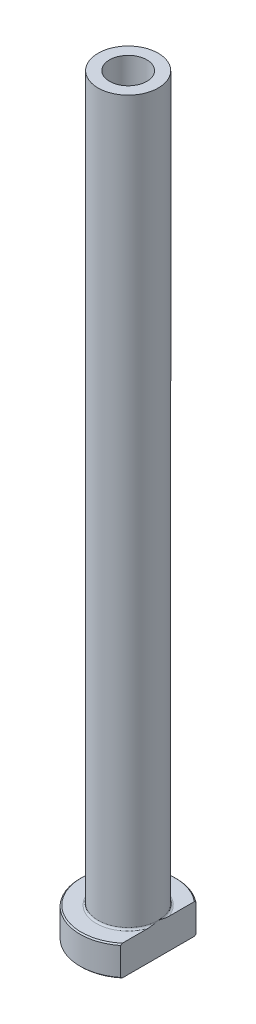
from build123d import *

# Parameters (mm, degrees)
FILLET1_R          = 0.3
CHAMFER1_SIZE      = 0.2
CUT_EXTRUDE1_DEPTH = 126.510955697
CHAMFER2_SIZE      = 0.5


with BuildPart() as part:
    # Sketch1 → Revolve1 (revolve)
    with BuildSketch(Plane.XY, mode=Mode.PRIVATE) as revolve1_sk:
        Polygon((-3.1, 125), (-5, 125), (-5, 5), (-8, 5), (-8, 0), (-3.35, 0), (-3.35, 68), (-3.1, 80), align=None)
    revolve(revolve1_sk.sketch.rotate(Axis((0, 92.187680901, 0), (0, -1, 0)), 270), axis=Axis((0, 92.187680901, 0), (0, -1, 0)))

    # Fillet1
    fillet1_edges = [part.edges().sort_by_distance(p)[0] for p in [
        (0, 5, -5),
    ]]
    fillet(fillet1_edges, radius=FILLET1_R)

    # Chamfer1
    chamfer1_edges = [part.edges().sort_by_distance(p)[0] for p in [
        (0, 0, -8),
        (0, 5, -8),
    ]]
    chamfer(chamfer1_edges, length=CHAMFER1_SIZE)

    # Sketch2 → Cut-Extrude1 (cut, through all)
    with BuildSketch(Plane.XZ):
        with BuildLine():
            Line((5, 6.244997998), (5, -6.244997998))
            ThreePointArc((5, -6.244997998), (8, 0), (5, 6.244997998))
        make_face()
    extrude(amount=-CUT_EXTRUDE1_DEPTH, mode=Mode.SUBTRACT)

    # Chamfer2
    chamfer2_edges = [part.edges().sort_by_distance(p)[0] for p in [
        (0, 0, -3.35),
    ]]
    chamfer(chamfer2_edges, length=CHAMFER2_SIZE)


solid = part.part
